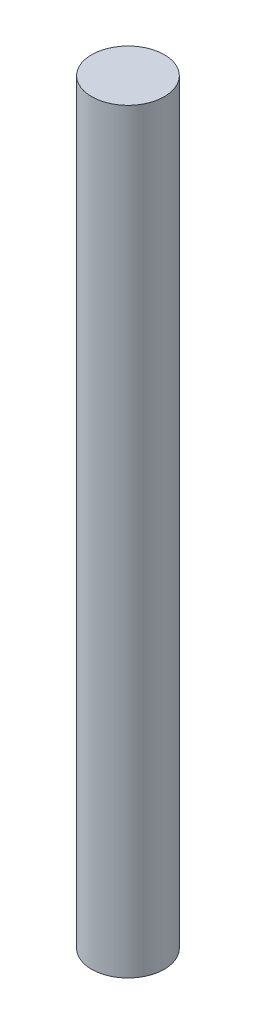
ISO-10303-21;
HEADER;
FILE_DESCRIPTION(('STEP AP214'),'2;1');
FILE_NAME('part.step','',(''),(''),'','','');
FILE_SCHEMA(('AUTOMOTIVE_DESIGN { 1 0 10303 214 1 1 1 1 }'));
ENDSEC;
DATA;
#1=APPLICATION_CONTEXT('core data for automotive mechanical design processes');
#2=APPLICATION_PROTOCOL_DEFINITION('international standard','automotive_design',2000,#1);
#3=PRODUCT_CONTEXT('',#1,'mechanical');
#4=PRODUCT('Part','Part','',(#3));
#5=PRODUCT_RELATED_PRODUCT_CATEGORY('part','',(#4));
#6=PRODUCT_DEFINITION_FORMATION('','',#4);
#7=PRODUCT_DEFINITION_CONTEXT('part definition',#1,'design');
#8=PRODUCT_DEFINITION('design','',#6,#7);
#9=PRODUCT_DEFINITION_SHAPE('','',#8);
#10=(LENGTH_UNIT() NAMED_UNIT(*) SI_UNIT(.MILLI.,.METRE.));
#11=(NAMED_UNIT(*) PLANE_ANGLE_UNIT() SI_UNIT($,.RADIAN.));
#12=(NAMED_UNIT(*) SI_UNIT($,.STERADIAN.) SOLID_ANGLE_UNIT());
#13=UNCERTAINTY_MEASURE_WITH_UNIT(LENGTH_MEASURE(1.E-05),#10,'distance_accuracy_value','');
#14=(GEOMETRIC_REPRESENTATION_CONTEXT(3) GLOBAL_UNCERTAINTY_ASSIGNED_CONTEXT((#13)) GLOBAL_UNIT_ASSIGNED_CONTEXT((#10,
#11,#12)) REPRESENTATION_CONTEXT('',''));
#15=CARTESIAN_POINT('',(0.,0.,0.));
#16=DIRECTION('',(0.,0.,1.));
#17=DIRECTION('',(1.,0.,0.));
#18=AXIS2_PLACEMENT_3D('',#15,#16,#17);
#19=CARTESIAN_POINT('',(0.,16.51,0.));
#20=DIRECTION('',(0.,-1.,0.));
#21=DIRECTION('',(0.,0.,-1.));
#22=AXIS2_PLACEMENT_3D('',#19,#20,#21);
#23=CYLINDRICAL_SURFACE('',#22,0.79375);
#24=CARTESIAN_POINT('',(0.,16.51,0.));
#25=DIRECTION('',(0.,1.,0.));
#26=DIRECTION('',(0.,0.,1.));
#27=AXIS2_PLACEMENT_3D('',#24,#25,#26);
#28=CIRCLE('',#27,0.79375);
#29=CARTESIAN_POINT('',(0.,16.51,0.79375));
#30=VERTEX_POINT('',#29);
#31=EDGE_CURVE('E10',#30,#30,#28,.T.);
#32=ORIENTED_EDGE('',*,*,#31,.F.);
#33=EDGE_LOOP('',(#32));
#34=FACE_BOUND('',#33,.T.);
#35=CARTESIAN_POINT('',(0.,0.,0.));
#36=DIRECTION('',(0.,1.,0.));
#37=DIRECTION('',(0.,0.,1.));
#38=AXIS2_PLACEMENT_3D('',#35,#36,#37);
#39=CIRCLE('',#38,0.79375);
#40=CARTESIAN_POINT('',(0.,0.,0.79375));
#41=VERTEX_POINT('',#40);
#42=EDGE_CURVE('E46',#41,#41,#39,.T.);
#43=ORIENTED_EDGE('',*,*,#42,.T.);
#44=EDGE_LOOP('',(#43));
#45=FACE_BOUND('',#44,.T.);
#46=ADVANCED_FACE('F43',(#34,#45),#23,.T.);
#47=CARTESIAN_POINT('',(0.,16.51,0.));
#48=DIRECTION('',(0.,1.,0.));
#49=DIRECTION('',(0.,0.,1.));
#50=AXIS2_PLACEMENT_3D('',#47,#48,#49);
#51=PLANE('',#50);
#52=ORIENTED_EDGE('',*,*,#31,.T.);
#53=EDGE_LOOP('',(#52));
#54=FACE_BOUND('',#53,.T.);
#55=ADVANCED_FACE('F60',(#54),#51,.T.);
#56=CARTESIAN_POINT('',(0.,0.,0.));
#57=DIRECTION('',(0.,1.,0.));
#58=DIRECTION('',(0.,0.,1.));
#59=AXIS2_PLACEMENT_3D('',#56,#57,#58);
#60=PLANE('',#59);
#61=ORIENTED_EDGE('',*,*,#42,.F.);
#62=EDGE_LOOP('',(#61));
#63=FACE_BOUND('',#62,.T.);
#64=ADVANCED_FACE('F58',(#63),#60,.F.);
#65=CLOSED_SHELL('',(#46,#55,#64));
#66=MANIFOLD_SOLID_BREP('B2',#65);
#67=ADVANCED_BREP_SHAPE_REPRESENTATION('',(#18,#66),#14);
#68=SHAPE_DEFINITION_REPRESENTATION(#9,#67);
ENDSEC;
END-ISO-10303-21;
